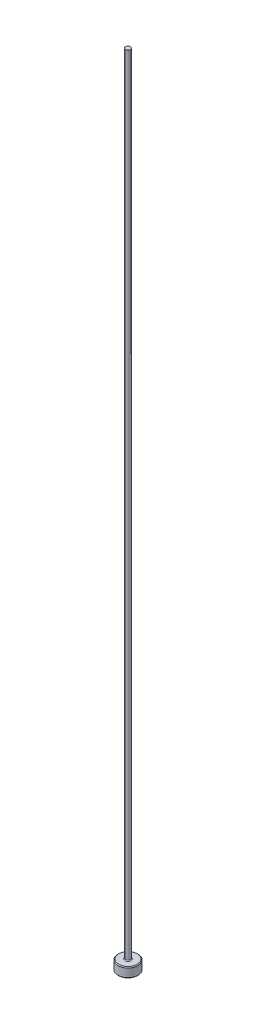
ISO-10303-21;
HEADER;
FILE_DESCRIPTION(('STEP AP214'),'2;1');
FILE_NAME('part.step','',(''),(''),'','','');
FILE_SCHEMA(('AUTOMOTIVE_DESIGN { 1 0 10303 214 1 1 1 1 }'));
ENDSEC;
DATA;
#1=APPLICATION_CONTEXT('core data for automotive mechanical design processes');
#2=APPLICATION_PROTOCOL_DEFINITION('international standard','automotive_design',2000,#1);
#3=PRODUCT_CONTEXT('',#1,'mechanical');
#4=PRODUCT('Part','Part','',(#3));
#5=PRODUCT_RELATED_PRODUCT_CATEGORY('part','',(#4));
#6=PRODUCT_DEFINITION_FORMATION('','',#4);
#7=PRODUCT_DEFINITION_CONTEXT('part definition',#1,'design');
#8=PRODUCT_DEFINITION('design','',#6,#7);
#9=PRODUCT_DEFINITION_SHAPE('','',#8);
#10=(LENGTH_UNIT() NAMED_UNIT(*) SI_UNIT(.MILLI.,.METRE.));
#11=(NAMED_UNIT(*) PLANE_ANGLE_UNIT() SI_UNIT($,.RADIAN.));
#12=(NAMED_UNIT(*) SI_UNIT($,.STERADIAN.) SOLID_ANGLE_UNIT());
#13=UNCERTAINTY_MEASURE_WITH_UNIT(LENGTH_MEASURE(1.E-05),#10,'distance_accuracy_value','');
#14=(GEOMETRIC_REPRESENTATION_CONTEXT(3) GLOBAL_UNCERTAINTY_ASSIGNED_CONTEXT((#13)) GLOBAL_UNIT_ASSIGNED_CONTEXT((#10,
#11,#12)) REPRESENTATION_CONTEXT('',''));
#15=CARTESIAN_POINT('',(0.,0.,0.));
#16=DIRECTION('',(0.,0.,1.));
#17=DIRECTION('',(1.,0.,0.));
#18=AXIS2_PLACEMENT_3D('',#15,#16,#17);
#19=CARTESIAN_POINT('',(0.,0.,0.));
#20=DIRECTION('',(0.,-1.,0.));
#21=DIRECTION('',(0.,0.,-1.));
#22=AXIS2_PLACEMENT_3D('',#19,#20,#21);
#23=PLANE('',#22);
#24=CARTESIAN_POINT('',(0.,0.,0.));
#25=DIRECTION('',(0.,-1.,0.));
#26=DIRECTION('',(0.,0.,-1.));
#27=AXIS2_PLACEMENT_3D('',#24,#25,#26);
#28=CIRCLE('',#27,2.92099999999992);
#29=CARTESIAN_POINT('',(0.,0.,-2.92099999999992));
#30=VERTEX_POINT('',#29);
#31=EDGE_CURVE('E41',#30,#30,#28,.T.);
#32=ORIENTED_EDGE('',*,*,#31,.T.);
#33=EDGE_LOOP('',(#32));
#34=FACE_BOUND('',#33,.T.);
#35=ADVANCED_FACE('F30',(#34),#23,.T.);
#36=CARTESIAN_POINT('',(0.,259.958771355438,0.));
#37=DIRECTION('',(0.,1.,0.));
#38=DIRECTION('',(0.,0.,1.));
#39=AXIS2_PLACEMENT_3D('',#36,#37,#38);
#40=CYLINDRICAL_SURFACE('',#39,3.17499999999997);
#41=CARTESIAN_POINT('',(0.,2.92100000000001,0.));
#42=DIRECTION('',(0.,1.,0.));
#43=DIRECTION('',(0.,0.,1.));
#44=AXIS2_PLACEMENT_3D('',#41,#42,#43);
#45=CIRCLE('',#44,3.17499999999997);
#46=CARTESIAN_POINT('',(0.,2.92100000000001,3.17499999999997));
#47=VERTEX_POINT('',#46);
#48=EDGE_CURVE('E45',#47,#47,#45,.F.);
#49=ORIENTED_EDGE('',*,*,#48,.T.);
#50=EDGE_LOOP('',(#49));
#51=FACE_BOUND('',#50,.T.);
#52=CARTESIAN_POINT('',(0.,0.254000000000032,0.));
#53=DIRECTION('',(0.,-1.,0.));
#54=DIRECTION('',(0.,0.,-1.));
#55=AXIS2_PLACEMENT_3D('',#52,#53,#54);
#56=CIRCLE('',#55,3.17499999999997);
#57=CARTESIAN_POINT('',(0.,0.254000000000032,-3.17499999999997));
#58=VERTEX_POINT('',#57);
#59=EDGE_CURVE('E50',#58,#58,#56,.F.);
#60=ORIENTED_EDGE('',*,*,#59,.T.);
#61=EDGE_LOOP('',(#60));
#62=FACE_BOUND('',#61,.T.);
#63=ADVANCED_FACE('F72',(#51,#62),#40,.T.);
#64=CARTESIAN_POINT('',(-3.17499999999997,3.175,0.));
#65=DIRECTION('',(0.,1.,0.));
#66=DIRECTION('',(0.,0.,1.));
#67=AXIS2_PLACEMENT_3D('',#64,#65,#66);
#68=PLANE('',#67);
#69=CARTESIAN_POINT('',(0.,3.175,0.));
#70=DIRECTION('',(0.,1.,0.));
#71=DIRECTION('',(0.,0.,1.));
#72=AXIS2_PLACEMENT_3D('',#69,#70,#71);
#73=CIRCLE('',#72,1.04774999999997);
#74=CARTESIAN_POINT('',(0.,3.175,1.04774999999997));
#75=VERTEX_POINT('',#74);
#76=EDGE_CURVE('E10',#75,#75,#73,.F.);
#77=ORIENTED_EDGE('',*,*,#76,.T.);
#78=EDGE_LOOP('',(#77));
#79=FACE_BOUND('',#78,.T.);
#80=CARTESIAN_POINT('',(0.,3.175,0.));
#81=DIRECTION('',(0.,1.,0.));
#82=DIRECTION('',(0.,0.,1.));
#83=AXIS2_PLACEMENT_3D('',#80,#81,#82);
#84=CIRCLE('',#83,2.92099999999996);
#85=CARTESIAN_POINT('',(0.,3.175,2.92099999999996));
#86=VERTEX_POINT('',#85);
#87=EDGE_CURVE('E53',#86,#86,#84,.T.);
#88=ORIENTED_EDGE('',*,*,#87,.T.);
#89=EDGE_LOOP('',(#88));
#90=FACE_BOUND('',#89,.T.);
#91=ADVANCED_FACE('F64',(#79,#90),#68,.T.);
#92=CARTESIAN_POINT('',(0.,259.958771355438,0.));
#93=DIRECTION('',(0.,1.,0.));
#94=DIRECTION('',(0.,0.,1.));
#95=AXIS2_PLACEMENT_3D('',#92,#93,#94);
#96=CYLINDRICAL_SURFACE('',#95,0.793749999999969);
#97=CARTESIAN_POINT('',(0.,3.42900000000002,0.));
#98=DIRECTION('',(0.,1.,0.));
#99=DIRECTION('',(0.,0.,1.));
#100=AXIS2_PLACEMENT_3D('',#97,#98,#99);
#101=CIRCLE('',#100,0.793749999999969);
#102=CARTESIAN_POINT('',(0.,3.42900000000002,0.793749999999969));
#103=VERTEX_POINT('',#102);
#104=EDGE_CURVE('E37',#103,#103,#101,.T.);
#105=ORIENTED_EDGE('',*,*,#104,.T.);
#106=EDGE_LOOP('',(#105));
#107=FACE_BOUND('',#106,.T.);
#108=CARTESIAN_POINT('',(0.,254.,0.));
#109=DIRECTION('',(0.,1.,0.));
#110=DIRECTION('',(0.,0.,1.));
#111=AXIS2_PLACEMENT_3D('',#108,#109,#110);
#112=CIRCLE('',#111,0.793749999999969);
#113=CARTESIAN_POINT('',(0.,254.,0.793749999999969));
#114=VERTEX_POINT('',#113);
#115=EDGE_CURVE('E56',#114,#114,#112,.T.);
#116=ORIENTED_EDGE('',*,*,#115,.F.);
#117=EDGE_LOOP('',(#116));
#118=FACE_BOUND('',#117,.T.);
#119=ADVANCED_FACE('F62',(#107,#118),#96,.T.);
#120=CARTESIAN_POINT('',(-0.793749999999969,254.,0.));
#121=DIRECTION('',(0.,1.,0.));
#122=DIRECTION('',(0.,0.,1.));
#123=AXIS2_PLACEMENT_3D('',#120,#121,#122);
#124=PLANE('',#123);
#125=ORIENTED_EDGE('',*,*,#115,.T.);
#126=EDGE_LOOP('',(#125));
#127=FACE_BOUND('',#126,.T.);
#128=ADVANCED_FACE('F60',(#127),#124,.T.);
#129=CARTESIAN_POINT('',(0.,3.17499999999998,0.));
#130=DIRECTION('',(0.,-1.,0.));
#131=DIRECTION('',(0.,0.,-1.));
#132=AXIS2_PLACEMENT_3D('',#129,#130,#131);
#133=CONICAL_SURFACE('',#132,2.92099999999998,0.785398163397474);
#134=ORIENTED_EDGE('',*,*,#48,.F.);
#135=EDGE_LOOP('',(#134));
#136=FACE_BOUND('',#135,.T.);
#137=ORIENTED_EDGE('',*,*,#87,.F.);
#138=EDGE_LOOP('',(#137));
#139=FACE_BOUND('',#138,.T.);
#140=ADVANCED_FACE('F70',(#136,#139),#133,.T.);
#141=CARTESIAN_POINT('',(0.,0.254000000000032,0.));
#142=DIRECTION('',(0.,1.,0.));
#143=DIRECTION('',(0.,0.,1.));
#144=AXIS2_PLACEMENT_3D('',#141,#142,#143);
#145=CONICAL_SURFACE('',#144,3.17499999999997,0.785398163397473);
#146=ORIENTED_EDGE('',*,*,#31,.F.);
#147=EDGE_LOOP('',(#146));
#148=FACE_BOUND('',#147,.T.);
#149=ORIENTED_EDGE('',*,*,#59,.F.);
#150=EDGE_LOOP('',(#149));
#151=FACE_BOUND('',#150,.T.);
#152=ADVANCED_FACE('F84',(#148,#151),#145,.T.);
#153=CARTESIAN_POINT('',(0.,3.42900000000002,0.));
#154=DIRECTION('',(0.,1.,0.));
#155=DIRECTION('',(0.,0.,1.));
#156=AXIS2_PLACEMENT_3D('',#153,#154,#155);
#157=TOROIDAL_SURFACE('',#156,1.04774999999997,0.254);
#158=ORIENTED_EDGE('',*,*,#76,.F.);
#159=EDGE_LOOP('',(#158));
#160=FACE_BOUND('',#159,.T.);
#161=ORIENTED_EDGE('',*,*,#104,.F.);
#162=EDGE_LOOP('',(#161));
#163=FACE_BOUND('',#162,.T.);
#164=ADVANCED_FACE('F32',(#160,#163),#157,.F.);
#165=CLOSED_SHELL('',(#35,#63,#91,#119,#128,#140,#152,#164));
#166=MANIFOLD_SOLID_BREP('B2',#165);
#167=ADVANCED_BREP_SHAPE_REPRESENTATION('',(#18,#166),#14);
#168=SHAPE_DEFINITION_REPRESENTATION(#9,#167);
ENDSEC;
END-ISO-10303-21;
